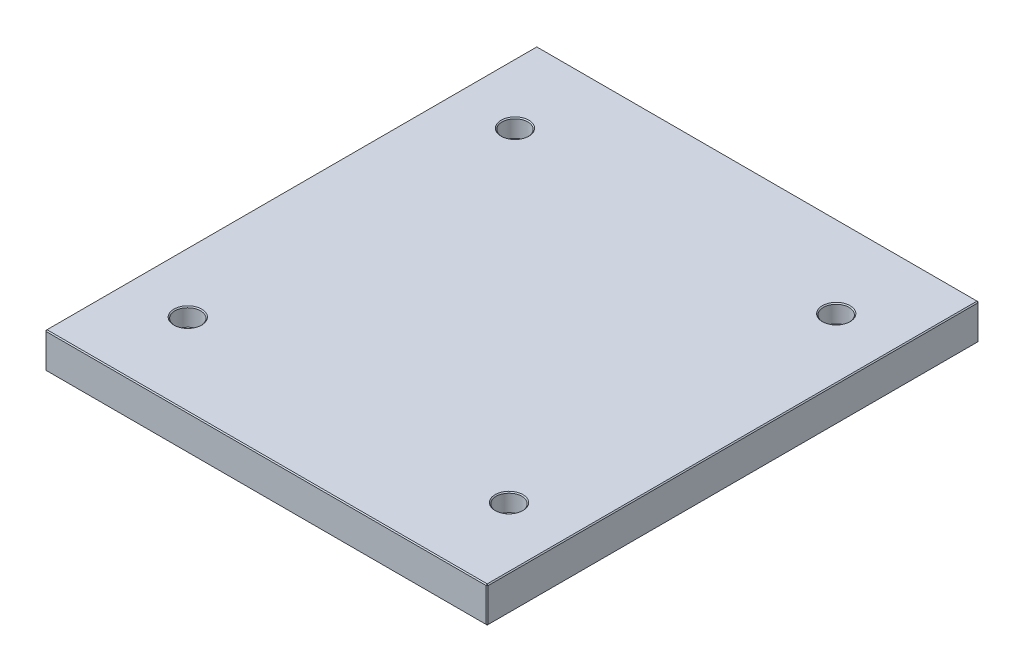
ISO-10303-21;
HEADER;
FILE_DESCRIPTION(('STEP AP214'),'2;1');
FILE_NAME('part.step','',(''),(''),'','','');
FILE_SCHEMA(('AUTOMOTIVE_DESIGN { 1 0 10303 214 1 1 1 1 }'));
ENDSEC;
DATA;
#1=APPLICATION_CONTEXT('core data for automotive mechanical design processes');
#2=APPLICATION_PROTOCOL_DEFINITION('international standard','automotive_design',2000,#1);
#3=PRODUCT_CONTEXT('',#1,'mechanical');
#4=PRODUCT('Part','Part','',(#3));
#5=PRODUCT_RELATED_PRODUCT_CATEGORY('part','',(#4));
#6=PRODUCT_DEFINITION_FORMATION('','',#4);
#7=PRODUCT_DEFINITION_CONTEXT('part definition',#1,'design');
#8=PRODUCT_DEFINITION('design','',#6,#7);
#9=PRODUCT_DEFINITION_SHAPE('','',#8);
#10=(LENGTH_UNIT() NAMED_UNIT(*) SI_UNIT(.MILLI.,.METRE.));
#11=(NAMED_UNIT(*) PLANE_ANGLE_UNIT() SI_UNIT($,.RADIAN.));
#12=(NAMED_UNIT(*) SI_UNIT($,.STERADIAN.) SOLID_ANGLE_UNIT());
#13=UNCERTAINTY_MEASURE_WITH_UNIT(LENGTH_MEASURE(1.E-05),#10,'distance_accuracy_value','');
#14=(GEOMETRIC_REPRESENTATION_CONTEXT(3) GLOBAL_UNCERTAINTY_ASSIGNED_CONTEXT((#13)) GLOBAL_UNIT_ASSIGNED_CONTEXT((#10,
#11,#12)) REPRESENTATION_CONTEXT('',''));
#15=CARTESIAN_POINT('',(0.,0.,0.));
#16=DIRECTION('',(0.,0.,1.));
#17=DIRECTION('',(1.,0.,0.));
#18=AXIS2_PLACEMENT_3D('',#15,#16,#17);
#19=CARTESIAN_POINT('',(-223.,36.,248.));
#20=DIRECTION('',(1.,0.,0.));
#21=DIRECTION('',(0.,0.,-1.));
#22=AXIS2_PLACEMENT_3D('',#19,#20,#21);
#23=PLANE('',#22);
#24=DIRECTION('',(0.,-1.,0.));
#25=VECTOR('',#24,1.);
#26=CARTESIAN_POINT('',(-223.,36.,-247.));
#27=LINE('',#26,#25);
#28=CARTESIAN_POINT('',(-223.,35.,-247.));
#29=VERTEX_POINT('',#28);
#30=CARTESIAN_POINT('',(-223.,0.999999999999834,-247.));
#31=VERTEX_POINT('',#30);
#32=EDGE_CURVE('E115',#29,#31,#27,.T.);
#33=ORIENTED_EDGE('',*,*,#32,.T.);
#34=DIRECTION('',(0.,0.,1.));
#35=VECTOR('',#34,1.);
#36=CARTESIAN_POINT('',(-223.,0.999999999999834,248.));
#37=LINE('',#36,#35);
#38=CARTESIAN_POINT('',(-223.,0.999999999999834,247.));
#39=VERTEX_POINT('',#38);
#40=EDGE_CURVE('E111',#31,#39,#37,.T.);
#41=ORIENTED_EDGE('',*,*,#40,.T.);
#42=DIRECTION('',(0.,1.,0.));
#43=VECTOR('',#42,1.);
#44=CARTESIAN_POINT('',(-223.,36.,247.));
#45=LINE('',#44,#43);
#46=CARTESIAN_POINT('',(-223.,35.,247.));
#47=VERTEX_POINT('',#46);
#48=EDGE_CURVE('E104',#39,#47,#45,.T.);
#49=ORIENTED_EDGE('',*,*,#48,.T.);
#50=DIRECTION('',(0.,0.,-1.));
#51=VECTOR('',#50,1.);
#52=CARTESIAN_POINT('',(-223.,35.,-248.));
#53=LINE('',#52,#51);
#54=EDGE_CURVE('E108',#47,#29,#53,.T.);
#55=ORIENTED_EDGE('',*,*,#54,.T.);
#56=EDGE_LOOP('',(#33,#41,#49,#55));
#57=FACE_BOUND('',#56,.T.);
#58=ADVANCED_FACE('F16',(#57),#23,.F.);
#59=CARTESIAN_POINT('',(223.,36.,248.));
#60=DIRECTION('',(0.,0.,-1.));
#61=DIRECTION('',(-1.,0.,0.));
#62=AXIS2_PLACEMENT_3D('',#59,#60,#61);
#63=PLANE('',#62);
#64=DIRECTION('',(-1.,0.,0.));
#65=VECTOR('',#64,1.);
#66=CARTESIAN_POINT('',(-223.,35.,248.));
#67=LINE('',#66,#65);
#68=CARTESIAN_POINT('',(222.,35.,248.));
#69=VERTEX_POINT('',#68);
#70=CARTESIAN_POINT('',(-222.,35.,248.));
#71=VERTEX_POINT('',#70);
#72=EDGE_CURVE('E170',#69,#71,#67,.T.);
#73=ORIENTED_EDGE('',*,*,#72,.T.);
#74=DIRECTION('',(0.,-1.,0.));
#75=VECTOR('',#74,1.);
#76=CARTESIAN_POINT('',(-222.,36.,248.));
#77=LINE('',#76,#75);
#78=CARTESIAN_POINT('',(-222.,0.99999999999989,248.));
#79=VERTEX_POINT('',#78);
#80=EDGE_CURVE('E123',#71,#79,#77,.T.);
#81=ORIENTED_EDGE('',*,*,#80,.T.);
#82=DIRECTION('',(1.,0.,0.));
#83=VECTOR('',#82,1.);
#84=CARTESIAN_POINT('',(223.,0.99999999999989,248.));
#85=LINE('',#84,#83);
#86=CARTESIAN_POINT('',(222.,0.99999999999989,248.));
#87=VERTEX_POINT('',#86);
#88=EDGE_CURVE('E174',#79,#87,#85,.T.);
#89=ORIENTED_EDGE('',*,*,#88,.T.);
#90=DIRECTION('',(0.,1.,0.));
#91=VECTOR('',#90,1.);
#92=CARTESIAN_POINT('',(222.,36.,248.));
#93=LINE('',#92,#91);
#94=EDGE_CURVE('E172',#87,#69,#93,.T.);
#95=ORIENTED_EDGE('',*,*,#94,.T.);
#96=EDGE_LOOP('',(#73,#81,#89,#95));
#97=FACE_BOUND('',#96,.T.);
#98=ADVANCED_FACE('F317',(#97),#63,.F.);
#99=CARTESIAN_POINT('',(223.,36.,248.));
#100=DIRECTION('',(-1.,0.,0.));
#101=DIRECTION('',(0.,0.,1.));
#102=AXIS2_PLACEMENT_3D('',#99,#100,#101);
#103=PLANE('',#102);
#104=DIRECTION('',(0.,0.,-1.));
#105=VECTOR('',#104,1.);
#106=CARTESIAN_POINT('',(223.,0.99999999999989,248.));
#107=LINE('',#106,#105);
#108=CARTESIAN_POINT('',(223.,0.99999999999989,247.));
#109=VERTEX_POINT('',#108);
#110=CARTESIAN_POINT('',(223.,0.99999999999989,-247.));
#111=VERTEX_POINT('',#110);
#112=EDGE_CURVE('E165',#109,#111,#107,.T.);
#113=ORIENTED_EDGE('',*,*,#112,.T.);
#114=DIRECTION('',(0.,1.,0.));
#115=VECTOR('',#114,1.);
#116=CARTESIAN_POINT('',(223.,36.,-247.));
#117=LINE('',#116,#115);
#118=CARTESIAN_POINT('',(223.,35.,-247.));
#119=VERTEX_POINT('',#118);
#120=EDGE_CURVE('E167',#111,#119,#117,.T.);
#121=ORIENTED_EDGE('',*,*,#120,.T.);
#122=DIRECTION('',(0.,0.,1.));
#123=VECTOR('',#122,1.);
#124=CARTESIAN_POINT('',(223.,35.,248.));
#125=LINE('',#124,#123);
#126=CARTESIAN_POINT('',(223.,35.,247.));
#127=VERTEX_POINT('',#126);
#128=EDGE_CURVE('E161',#119,#127,#125,.T.);
#129=ORIENTED_EDGE('',*,*,#128,.T.);
#130=DIRECTION('',(0.,-1.,0.));
#131=VECTOR('',#130,1.);
#132=CARTESIAN_POINT('',(223.,36.,247.));
#133=LINE('',#132,#131);
#134=EDGE_CURVE('E163',#127,#109,#133,.T.);
#135=ORIENTED_EDGE('',*,*,#134,.T.);
#136=EDGE_LOOP('',(#113,#121,#129,#135));
#137=FACE_BOUND('',#136,.T.);
#138=ADVANCED_FACE('F323',(#137),#103,.F.);
#139=CARTESIAN_POINT('',(223.,36.,-248.));
#140=DIRECTION('',(0.,0.,1.));
#141=DIRECTION('',(1.,0.,0.));
#142=AXIS2_PLACEMENT_3D('',#139,#140,#141);
#143=PLANE('',#142);
#144=DIRECTION('',(0.,-1.,0.));
#145=VECTOR('',#144,1.);
#146=CARTESIAN_POINT('',(222.,36.,-248.));
#147=LINE('',#146,#145);
#148=CARTESIAN_POINT('',(222.,35.,-248.));
#149=VERTEX_POINT('',#148);
#150=CARTESIAN_POINT('',(222.,0.99999999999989,-248.));
#151=VERTEX_POINT('',#150);
#152=EDGE_CURVE('E154',#149,#151,#147,.T.);
#153=ORIENTED_EDGE('',*,*,#152,.T.);
#154=DIRECTION('',(-1.,0.,0.));
#155=VECTOR('',#154,1.);
#156=CARTESIAN_POINT('',(223.,0.99999999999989,-248.));
#157=LINE('',#156,#155);
#158=CARTESIAN_POINT('',(-222.,0.99999999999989,-248.));
#159=VERTEX_POINT('',#158);
#160=EDGE_CURVE('E159',#151,#159,#157,.T.);
#161=ORIENTED_EDGE('',*,*,#160,.T.);
#162=DIRECTION('',(0.,1.,0.));
#163=VECTOR('',#162,1.);
#164=CARTESIAN_POINT('',(-222.,36.,-248.));
#165=LINE('',#164,#163);
#166=CARTESIAN_POINT('',(-222.,35.,-248.));
#167=VERTEX_POINT('',#166);
#168=EDGE_CURVE('E156',#159,#167,#165,.T.);
#169=ORIENTED_EDGE('',*,*,#168,.T.);
#170=DIRECTION('',(1.,0.,0.));
#171=VECTOR('',#170,1.);
#172=CARTESIAN_POINT('',(223.,35.,-248.));
#173=LINE('',#172,#171);
#174=EDGE_CURVE('E152',#167,#149,#173,.T.);
#175=ORIENTED_EDGE('',*,*,#174,.T.);
#176=EDGE_LOOP('',(#153,#161,#169,#175));
#177=FACE_BOUND('',#176,.T.);
#178=ADVANCED_FACE('F465',(#177),#143,.F.);
#179=CARTESIAN_POINT('',(0.,36.,0.));
#180=DIRECTION('',(0.,1.,0.));
#181=DIRECTION('',(0.,0.,1.));
#182=AXIS2_PLACEMENT_3D('',#179,#180,#181);
#183=PLANE('',#182);
#184=CARTESIAN_POINT('',(-162.,36.,165.));
#185=DIRECTION('',(0.,1.,0.));
#186=DIRECTION('',(0.,0.,1.));
#187=AXIS2_PLACEMENT_3D('',#184,#185,#186);
#188=CIRCLE('',#187,14.0000000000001);
#189=CARTESIAN_POINT('',(-162.,36.,179.));
#190=VERTEX_POINT('',#189);
#191=EDGE_CURVE('E290',#190,#190,#188,.F.);
#192=ORIENTED_EDGE('',*,*,#191,.T.);
#193=EDGE_LOOP('',(#192));
#194=FACE_BOUND('',#193,.T.);
#195=CARTESIAN_POINT('',(162.,36.,165.));
#196=DIRECTION('',(0.,1.,0.));
#197=DIRECTION('',(0.,0.,1.));
#198=AXIS2_PLACEMENT_3D('',#195,#196,#197);
#199=CIRCLE('',#198,14.0000000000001);
#200=CARTESIAN_POINT('',(162.,36.,179.));
#201=VERTEX_POINT('',#200);
#202=EDGE_CURVE('E287',#201,#201,#199,.F.);
#203=ORIENTED_EDGE('',*,*,#202,.T.);
#204=EDGE_LOOP('',(#203));
#205=FACE_BOUND('',#204,.T.);
#206=CARTESIAN_POINT('',(162.,36.,-165.));
#207=DIRECTION('',(0.,1.,0.));
#208=DIRECTION('',(0.,0.,1.));
#209=AXIS2_PLACEMENT_3D('',#206,#207,#208);
#210=CIRCLE('',#209,14.0000000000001);
#211=CARTESIAN_POINT('',(162.,36.,-151.));
#212=VERTEX_POINT('',#211);
#213=EDGE_CURVE('E284',#212,#212,#210,.F.);
#214=ORIENTED_EDGE('',*,*,#213,.T.);
#215=EDGE_LOOP('',(#214));
#216=FACE_BOUND('',#215,.T.);
#217=CARTESIAN_POINT('',(-162.,36.,-165.));
#218=DIRECTION('',(0.,1.,0.));
#219=DIRECTION('',(0.,0.,1.));
#220=AXIS2_PLACEMENT_3D('',#217,#218,#219);
#221=CIRCLE('',#220,14.0000000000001);
#222=CARTESIAN_POINT('',(-162.,36.,-151.));
#223=VERTEX_POINT('',#222);
#224=EDGE_CURVE('E281',#223,#223,#221,.F.);
#225=ORIENTED_EDGE('',*,*,#224,.T.);
#226=EDGE_LOOP('',(#225));
#227=FACE_BOUND('',#226,.T.);
#228=DIRECTION('',(0.,0.,-1.));
#229=VECTOR('',#228,1.);
#230=CARTESIAN_POINT('',(222.,36.,-248.));
#231=LINE('',#230,#229);
#232=CARTESIAN_POINT('',(222.,36.,247.));
#233=VERTEX_POINT('',#232);
#234=CARTESIAN_POINT('',(222.,36.,-247.));
#235=VERTEX_POINT('',#234);
#236=EDGE_CURVE('E31',#233,#235,#231,.T.);
#237=ORIENTED_EDGE('',*,*,#236,.T.);
#238=DIRECTION('',(-1.,0.,0.));
#239=VECTOR('',#238,1.);
#240=CARTESIAN_POINT('',(-223.,36.,-247.));
#241=LINE('',#240,#239);
#242=CARTESIAN_POINT('',(-222.,36.,-247.));
#243=VERTEX_POINT('',#242);
#244=EDGE_CURVE('E190',#235,#243,#241,.T.);
#245=ORIENTED_EDGE('',*,*,#244,.T.);
#246=DIRECTION('',(0.,0.,1.));
#247=VECTOR('',#246,1.);
#248=CARTESIAN_POINT('',(-222.,36.,248.));
#249=LINE('',#248,#247);
#250=CARTESIAN_POINT('',(-222.,36.,247.));
#251=VERTEX_POINT('',#250);
#252=EDGE_CURVE('E186',#243,#251,#249,.T.);
#253=ORIENTED_EDGE('',*,*,#252,.T.);
#254=DIRECTION('',(1.,0.,0.));
#255=VECTOR('',#254,1.);
#256=CARTESIAN_POINT('',(223.,36.,247.));
#257=LINE('',#256,#255);
#258=EDGE_CURVE('E36',#251,#233,#257,.T.);
#259=ORIENTED_EDGE('',*,*,#258,.T.);
#260=EDGE_LOOP('',(#237,#245,#253,#259));
#261=FACE_BOUND('',#260,.T.);
#262=ADVANCED_FACE('F462',(#194,#205,#216,#227,#261),#183,.T.);
#263=CARTESIAN_POINT('',(0.,0.,0.));
#264=DIRECTION('',(0.,1.,0.));
#265=DIRECTION('',(0.,0.,1.));
#266=AXIS2_PLACEMENT_3D('',#263,#264,#265);
#267=PLANE('',#266);
#268=CARTESIAN_POINT('',(162.,0.,-165.));
#269=DIRECTION('',(0.,1.,0.));
#270=DIRECTION('',(0.,0.,1.));
#271=AXIS2_PLACEMENT_3D('',#268,#269,#270);
#272=CIRCLE('',#271,10.);
#273=CARTESIAN_POINT('',(162.,0.,-155.));
#274=VERTEX_POINT('',#273);
#275=EDGE_CURVE('E263',#274,#274,#272,.T.);
#276=ORIENTED_EDGE('',*,*,#275,.T.);
#277=EDGE_LOOP('',(#276));
#278=FACE_BOUND('',#277,.T.);
#279=CARTESIAN_POINT('',(162.,0.,165.));
#280=DIRECTION('',(0.,1.,0.));
#281=DIRECTION('',(0.,0.,1.));
#282=AXIS2_PLACEMENT_3D('',#279,#280,#281);
#283=CIRCLE('',#282,9.99999999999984);
#284=CARTESIAN_POINT('',(162.,0.,175.));
#285=VERTEX_POINT('',#284);
#286=EDGE_CURVE('E260',#285,#285,#283,.T.);
#287=ORIENTED_EDGE('',*,*,#286,.T.);
#288=EDGE_LOOP('',(#287));
#289=FACE_BOUND('',#288,.T.);
#290=CARTESIAN_POINT('',(-162.,0.,165.));
#291=DIRECTION('',(0.,1.,0.));
#292=DIRECTION('',(0.,0.,1.));
#293=AXIS2_PLACEMENT_3D('',#290,#291,#292);
#294=CIRCLE('',#293,10.);
#295=CARTESIAN_POINT('',(-162.,0.,175.));
#296=VERTEX_POINT('',#295);
#297=EDGE_CURVE('E257',#296,#296,#294,.T.);
#298=ORIENTED_EDGE('',*,*,#297,.T.);
#299=EDGE_LOOP('',(#298));
#300=FACE_BOUND('',#299,.T.);
#301=CARTESIAN_POINT('',(-162.,0.,-165.));
#302=DIRECTION('',(0.,1.,0.));
#303=DIRECTION('',(0.,0.,1.));
#304=AXIS2_PLACEMENT_3D('',#301,#302,#303);
#305=CIRCLE('',#304,9.99999999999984);
#306=CARTESIAN_POINT('',(-162.,0.,-155.));
#307=VERTEX_POINT('',#306);
#308=EDGE_CURVE('E192',#307,#307,#305,.T.);
#309=ORIENTED_EDGE('',*,*,#308,.T.);
#310=EDGE_LOOP('',(#309));
#311=FACE_BOUND('',#310,.T.);
#312=DIRECTION('',(0.,0.,1.));
#313=VECTOR('',#312,1.);
#314=CARTESIAN_POINT('',(222.,0.,0.));
#315=LINE('',#314,#313);
#316=CARTESIAN_POINT('',(222.,0.,-247.));
#317=VERTEX_POINT('',#316);
#318=CARTESIAN_POINT('',(222.,0.,247.));
#319=VERTEX_POINT('',#318);
#320=EDGE_CURVE('E177',#317,#319,#315,.T.);
#321=ORIENTED_EDGE('',*,*,#320,.T.);
#322=DIRECTION('',(-1.,0.,0.));
#323=VECTOR('',#322,1.);
#324=CARTESIAN_POINT('',(0.,0.,247.));
#325=LINE('',#324,#323);
#326=CARTESIAN_POINT('',(-222.,0.,247.));
#327=VERTEX_POINT('',#326);
#328=EDGE_CURVE('E183',#319,#327,#325,.T.);
#329=ORIENTED_EDGE('',*,*,#328,.T.);
#330=DIRECTION('',(0.,0.,-1.));
#331=VECTOR('',#330,1.);
#332=CARTESIAN_POINT('',(-222.,0.,0.));
#333=LINE('',#332,#331);
#334=CARTESIAN_POINT('',(-222.,0.,-247.));
#335=VERTEX_POINT('',#334);
#336=EDGE_CURVE('E181',#327,#335,#333,.T.);
#337=ORIENTED_EDGE('',*,*,#336,.T.);
#338=DIRECTION('',(1.,0.,0.));
#339=VECTOR('',#338,1.);
#340=CARTESIAN_POINT('',(0.,0.,-247.));
#341=LINE('',#340,#339);
#342=EDGE_CURVE('E179',#335,#317,#341,.T.);
#343=ORIENTED_EDGE('',*,*,#342,.T.);
#344=EDGE_LOOP('',(#321,#329,#337,#343));
#345=FACE_BOUND('',#344,.T.);
#346=ADVANCED_FACE('F402',(#278,#289,#300,#311,#345),#267,.F.);
#347=CARTESIAN_POINT('',(223.,36.,247.));
#348=DIRECTION('',(-0.707106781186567,0.,-0.707106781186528));
#349=DIRECTION('',(0.,-1.,0.));
#350=AXIS2_PLACEMENT_3D('',#347,#348,#349);
#351=PLANE('',#350);
#352=DIRECTION('',(-0.707106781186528,0.,0.707106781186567));
#353=VECTOR('',#352,1.);
#354=CARTESIAN_POINT('',(222.,35.,248.));
#355=LINE('',#354,#353);
#356=EDGE_CURVE('E141',#69,#127,#355,.F.);
#357=ORIENTED_EDGE('',*,*,#356,.F.);
#358=ORIENTED_EDGE('',*,*,#94,.F.);
#359=DIRECTION('',(0.707106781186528,0.,-0.707106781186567));
#360=VECTOR('',#359,1.);
#361=CARTESIAN_POINT('',(222.,0.99999999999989,248.));
#362=LINE('',#361,#360);
#363=EDGE_CURVE('E144',#109,#87,#362,.F.);
#364=ORIENTED_EDGE('',*,*,#363,.F.);
#365=ORIENTED_EDGE('',*,*,#134,.F.);
#366=EDGE_LOOP('',(#357,#358,#364,#365));
#367=FACE_BOUND('',#366,.T.);
#368=ADVANCED_FACE('F398',(#367),#351,.F.);
#369=CARTESIAN_POINT('',(222.,35.,248.));
#370=DIRECTION('',(0.577350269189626,0.577350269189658,0.577350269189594));
#371=DIRECTION('',(-0.707106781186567,0.707106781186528,0.));
#372=AXIS2_PLACEMENT_3D('',#369,#370,#371);
#373=PLANE('',#372);
#374=DIRECTION('',(0.,-0.707106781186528,0.707106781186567));
#375=VECTOR('',#374,1.);
#376=CARTESIAN_POINT('',(222.,35.,248.));
#377=LINE('',#376,#375);
#378=EDGE_CURVE('E235',#69,#233,#377,.F.);
#379=ORIENTED_EDGE('',*,*,#378,.F.);
#380=ORIENTED_EDGE('',*,*,#356,.T.);
#381=DIRECTION('',(-0.707106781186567,0.707106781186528,0.));
#382=VECTOR('',#381,1.);
#383=CARTESIAN_POINT('',(222.5,35.5,247.));
#384=LINE('',#383,#382);
#385=EDGE_CURVE('E237',#233,#127,#384,.F.);
#386=ORIENTED_EDGE('',*,*,#385,.F.);
#387=EDGE_LOOP('',(#379,#380,#386));
#388=FACE_BOUND('',#387,.T.);
#389=ADVANCED_FACE('F394',(#388),#373,.T.);
#390=CARTESIAN_POINT('',(222.,0.99999999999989,248.));
#391=DIRECTION('',(0.577350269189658,-0.577350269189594,0.577350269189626));
#392=DIRECTION('',(0.707106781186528,0.,-0.707106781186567));
#393=AXIS2_PLACEMENT_3D('',#390,#391,#392);
#394=PLANE('',#393);
#395=DIRECTION('',(-0.707106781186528,-0.707106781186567,0.));
#396=VECTOR('',#395,1.);
#397=CARTESIAN_POINT('',(222.5,0.499999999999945,247.));
#398=LINE('',#397,#396);
#399=EDGE_CURVE('E229',#109,#319,#398,.T.);
#400=ORIENTED_EDGE('',*,*,#399,.F.);
#401=ORIENTED_EDGE('',*,*,#363,.T.);
#402=DIRECTION('',(0.,0.707106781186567,0.707106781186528));
#403=VECTOR('',#402,1.);
#404=CARTESIAN_POINT('',(222.,0.99999999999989,248.));
#405=LINE('',#404,#403);
#406=EDGE_CURVE('E232',#319,#87,#405,.T.);
#407=ORIENTED_EDGE('',*,*,#406,.F.);
#408=EDGE_LOOP('',(#400,#401,#407));
#409=FACE_BOUND('',#408,.T.);
#410=ADVANCED_FACE('F390',(#409),#394,.T.);
#411=CARTESIAN_POINT('',(222.,36.,0.));
#412=DIRECTION('',(0.707106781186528,0.707106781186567,0.));
#413=DIRECTION('',(0.,0.,1.));
#414=AXIS2_PLACEMENT_3D('',#411,#412,#413);
#415=PLANE('',#414);
#416=ORIENTED_EDGE('',*,*,#385,.T.);
#417=ORIENTED_EDGE('',*,*,#128,.F.);
#418=DIRECTION('',(0.707106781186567,-0.707106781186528,0.));
#419=VECTOR('',#418,1.);
#420=CARTESIAN_POINT('',(223.,35.,-247.));
#421=LINE('',#420,#419);
#422=EDGE_CURVE('E224',#235,#119,#421,.T.);
#423=ORIENTED_EDGE('',*,*,#422,.F.);
#424=ORIENTED_EDGE('',*,*,#236,.F.);
#425=EDGE_LOOP('',(#416,#417,#423,#424));
#426=FACE_BOUND('',#425,.T.);
#427=ADVANCED_FACE('F386',(#426),#415,.T.);
#428=CARTESIAN_POINT('',(0.,36.,247.));
#429=DIRECTION('',(0.,0.707106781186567,0.707106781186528));
#430=DIRECTION('',(-1.,0.,0.));
#431=AXIS2_PLACEMENT_3D('',#428,#429,#430);
#432=PLANE('',#431);
#433=ORIENTED_EDGE('',*,*,#378,.T.);
#434=ORIENTED_EDGE('',*,*,#258,.F.);
#435=DIRECTION('',(0.,0.707106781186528,-0.707106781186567));
#436=VECTOR('',#435,1.);
#437=CARTESIAN_POINT('',(-222.,35.5,247.5));
#438=LINE('',#437,#436);
#439=EDGE_CURVE('E127',#71,#251,#438,.T.);
#440=ORIENTED_EDGE('',*,*,#439,.F.);
#441=ORIENTED_EDGE('',*,*,#72,.F.);
#442=EDGE_LOOP('',(#433,#434,#440,#441));
#443=FACE_BOUND('',#442,.T.);
#444=ADVANCED_FACE('F383',(#443),#432,.T.);
#445=CARTESIAN_POINT('',(-222.,36.,248.));
#446=DIRECTION('',(0.707106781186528,0.,-0.707106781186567));
#447=DIRECTION('',(0.,-1.,0.));
#448=AXIS2_PLACEMENT_3D('',#445,#446,#447);
#449=PLANE('',#448);
#450=DIRECTION('',(0.707106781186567,0.,0.707106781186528));
#451=VECTOR('',#450,1.);
#452=CARTESIAN_POINT('',(-222.,0.99999999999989,248.));
#453=LINE('',#452,#451);
#454=EDGE_CURVE('E128',#79,#39,#453,.F.);
#455=ORIENTED_EDGE('',*,*,#454,.F.);
#456=ORIENTED_EDGE('',*,*,#80,.F.);
#457=DIRECTION('',(-0.707106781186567,0.,-0.707106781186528));
#458=VECTOR('',#457,1.);
#459=CARTESIAN_POINT('',(-223.,35.,247.));
#460=LINE('',#459,#458);
#461=EDGE_CURVE('E119',#47,#71,#460,.F.);
#462=ORIENTED_EDGE('',*,*,#461,.F.);
#463=ORIENTED_EDGE('',*,*,#48,.F.);
#464=EDGE_LOOP('',(#455,#456,#462,#463));
#465=FACE_BOUND('',#464,.T.);
#466=ADVANCED_FACE('F121',(#465),#449,.F.);
#467=CARTESIAN_POINT('',(223.,0.99999999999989,248.));
#468=DIRECTION('',(0.,0.707106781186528,-0.707106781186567));
#469=DIRECTION('',(1.,0.,0.));
#470=AXIS2_PLACEMENT_3D('',#467,#468,#469);
#471=PLANE('',#470);
#472=ORIENTED_EDGE('',*,*,#406,.T.);
#473=ORIENTED_EDGE('',*,*,#88,.F.);
#474=DIRECTION('',(0.,-0.707106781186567,-0.707106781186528));
#475=VECTOR('',#474,1.);
#476=CARTESIAN_POINT('',(-222.,0.99999999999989,248.));
#477=LINE('',#476,#475);
#478=EDGE_CURVE('E220',#327,#79,#477,.F.);
#479=ORIENTED_EDGE('',*,*,#478,.F.);
#480=ORIENTED_EDGE('',*,*,#328,.F.);
#481=EDGE_LOOP('',(#472,#473,#479,#480));
#482=FACE_BOUND('',#481,.T.);
#483=ADVANCED_FACE('F376',(#482),#471,.F.);
#484=CARTESIAN_POINT('',(223.,0.99999999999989,248.));
#485=DIRECTION('',(-0.707106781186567,0.707106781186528,0.));
#486=DIRECTION('',(0.,0.,-1.));
#487=AXIS2_PLACEMENT_3D('',#484,#485,#486);
#488=PLANE('',#487);
#489=ORIENTED_EDGE('',*,*,#399,.T.);
#490=ORIENTED_EDGE('',*,*,#320,.F.);
#491=DIRECTION('',(0.707106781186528,0.707106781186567,0.));
#492=VECTOR('',#491,1.);
#493=CARTESIAN_POINT('',(222.5,0.499999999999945,-247.));
#494=LINE('',#493,#492);
#495=EDGE_CURVE('E217',#111,#317,#494,.F.);
#496=ORIENTED_EDGE('',*,*,#495,.F.);
#497=ORIENTED_EDGE('',*,*,#112,.F.);
#498=EDGE_LOOP('',(#489,#490,#496,#497));
#499=FACE_BOUND('',#498,.T.);
#500=ADVANCED_FACE('F372',(#499),#488,.F.);
#501=CARTESIAN_POINT('',(222.,36.,-248.));
#502=DIRECTION('',(-0.707106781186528,0.,0.707106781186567));
#503=DIRECTION('',(0.,-1.,0.));
#504=AXIS2_PLACEMENT_3D('',#501,#502,#503);
#505=PLANE('',#504);
#506=DIRECTION('',(0.707106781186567,0.,0.707106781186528));
#507=VECTOR('',#506,1.);
#508=CARTESIAN_POINT('',(223.,35.,-247.));
#509=LINE('',#508,#507);
#510=EDGE_CURVE('E226',#119,#149,#509,.F.);
#511=ORIENTED_EDGE('',*,*,#510,.F.);
#512=ORIENTED_EDGE('',*,*,#120,.F.);
#513=DIRECTION('',(-0.707106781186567,0.,-0.707106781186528));
#514=VECTOR('',#513,1.);
#515=CARTESIAN_POINT('',(222.,0.99999999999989,-248.));
#516=LINE('',#515,#514);
#517=EDGE_CURVE('E214',#151,#111,#516,.F.);
#518=ORIENTED_EDGE('',*,*,#517,.F.);
#519=ORIENTED_EDGE('',*,*,#152,.F.);
#520=EDGE_LOOP('',(#511,#512,#518,#519));
#521=FACE_BOUND('',#520,.T.);
#522=ADVANCED_FACE('F368',(#521),#505,.F.);
#523=CARTESIAN_POINT('',(223.,35.,-247.));
#524=DIRECTION('',(0.577350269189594,0.577350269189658,-0.577350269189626));
#525=DIRECTION('',(0.,0.707106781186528,0.707106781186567));
#526=AXIS2_PLACEMENT_3D('',#523,#524,#525);
#527=PLANE('',#526);
#528=ORIENTED_EDGE('',*,*,#422,.T.);
#529=ORIENTED_EDGE('',*,*,#510,.T.);
#530=DIRECTION('',(0.,0.707106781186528,0.707106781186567));
#531=VECTOR('',#530,1.);
#532=CARTESIAN_POINT('',(222.,35.5,-247.5));
#533=LINE('',#532,#531);
#534=EDGE_CURVE('E135',#235,#149,#533,.F.);
#535=ORIENTED_EDGE('',*,*,#534,.F.);
#536=EDGE_LOOP('',(#528,#529,#535));
#537=FACE_BOUND('',#536,.T.);
#538=ADVANCED_FACE('F365',(#537),#527,.T.);
#539=CARTESIAN_POINT('',(-223.,35.,247.));
#540=DIRECTION('',(-0.577350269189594,0.577350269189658,0.577350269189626));
#541=DIRECTION('',(0.,-0.707106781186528,0.707106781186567));
#542=AXIS2_PLACEMENT_3D('',#539,#540,#541);
#543=PLANE('',#542);
#544=ORIENTED_EDGE('',*,*,#461,.T.);
#545=ORIENTED_EDGE('',*,*,#439,.T.);
#546=DIRECTION('',(-0.707106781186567,-0.707106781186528,0.));
#547=VECTOR('',#546,1.);
#548=CARTESIAN_POINT('',(-223.,35.,247.));
#549=LINE('',#548,#547);
#550=EDGE_CURVE('E131',#47,#251,#549,.F.);
#551=ORIENTED_EDGE('',*,*,#550,.F.);
#552=EDGE_LOOP('',(#544,#545,#551));
#553=FACE_BOUND('',#552,.T.);
#554=ADVANCED_FACE('F132',(#553),#543,.T.);
#555=CARTESIAN_POINT('',(-222.,0.99999999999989,248.));
#556=DIRECTION('',(-0.577350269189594,-0.577350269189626,0.577350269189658));
#557=DIRECTION('',(0.,-0.707106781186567,-0.707106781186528));
#558=AXIS2_PLACEMENT_3D('',#555,#556,#557);
#559=PLANE('',#558);
#560=ORIENTED_EDGE('',*,*,#478,.T.);
#561=ORIENTED_EDGE('',*,*,#454,.T.);
#562=DIRECTION('',(-0.707106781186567,0.707106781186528,0.));
#563=VECTOR('',#562,1.);
#564=CARTESIAN_POINT('',(-222.5,0.499999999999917,247.));
#565=LINE('',#564,#563);
#566=EDGE_CURVE('E136',#327,#39,#565,.T.);
#567=ORIENTED_EDGE('',*,*,#566,.F.);
#568=EDGE_LOOP('',(#560,#561,#567));
#569=FACE_BOUND('',#568,.T.);
#570=ADVANCED_FACE('F358',(#569),#559,.T.);
#571=CARTESIAN_POINT('',(222.,0.99999999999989,-248.));
#572=DIRECTION('',(0.577350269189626,-0.577350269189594,-0.577350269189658));
#573=DIRECTION('',(-0.707106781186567,0.,-0.707106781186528));
#574=AXIS2_PLACEMENT_3D('',#571,#572,#573);
#575=PLANE('',#574);
#576=ORIENTED_EDGE('',*,*,#517,.T.);
#577=ORIENTED_EDGE('',*,*,#495,.T.);
#578=DIRECTION('',(0.,-0.707106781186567,0.707106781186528));
#579=VECTOR('',#578,1.);
#580=CARTESIAN_POINT('',(222.,0.99999999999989,-248.));
#581=LINE('',#580,#579);
#582=EDGE_CURVE('E207',#151,#317,#581,.T.);
#583=ORIENTED_EDGE('',*,*,#582,.F.);
#584=EDGE_LOOP('',(#576,#577,#583));
#585=FACE_BOUND('',#584,.T.);
#586=ADVANCED_FACE('F354',(#585),#575,.T.);
#587=CARTESIAN_POINT('',(0.,36.,-247.));
#588=DIRECTION('',(0.,0.707106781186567,-0.707106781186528));
#589=DIRECTION('',(1.,0.,0.));
#590=AXIS2_PLACEMENT_3D('',#587,#588,#589);
#591=PLANE('',#590);
#592=ORIENTED_EDGE('',*,*,#534,.T.);
#593=ORIENTED_EDGE('',*,*,#174,.F.);
#594=DIRECTION('',(0.,-0.707106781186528,-0.707106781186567));
#595=VECTOR('',#594,1.);
#596=CARTESIAN_POINT('',(-222.,35.,-248.));
#597=LINE('',#596,#595);
#598=EDGE_CURVE('E204',#243,#167,#597,.T.);
#599=ORIENTED_EDGE('',*,*,#598,.F.);
#600=ORIENTED_EDGE('',*,*,#244,.F.);
#601=EDGE_LOOP('',(#592,#593,#599,#600));
#602=FACE_BOUND('',#601,.T.);
#603=ADVANCED_FACE('F351',(#602),#591,.T.);
#604=CARTESIAN_POINT('',(-222.,36.,0.));
#605=DIRECTION('',(-0.707106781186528,0.707106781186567,0.));
#606=DIRECTION('',(0.,0.,-1.));
#607=AXIS2_PLACEMENT_3D('',#604,#605,#606);
#608=PLANE('',#607);
#609=ORIENTED_EDGE('',*,*,#550,.T.);
#610=ORIENTED_EDGE('',*,*,#252,.F.);
#611=DIRECTION('',(0.707106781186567,0.707106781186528,0.));
#612=VECTOR('',#611,1.);
#613=CARTESIAN_POINT('',(-222.5,35.5,-247.));
#614=LINE('',#613,#612);
#615=EDGE_CURVE('E139',#29,#243,#614,.T.);
#616=ORIENTED_EDGE('',*,*,#615,.F.);
#617=ORIENTED_EDGE('',*,*,#54,.F.);
#618=EDGE_LOOP('',(#609,#610,#616,#617));
#619=FACE_BOUND('',#618,.T.);
#620=ADVANCED_FACE('F138',(#619),#608,.T.);
#621=CARTESIAN_POINT('',(-223.,0.999999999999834,248.));
#622=DIRECTION('',(0.707106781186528,0.707106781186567,0.));
#623=DIRECTION('',(0.,0.,1.));
#624=AXIS2_PLACEMENT_3D('',#621,#622,#623);
#625=PLANE('',#624);
#626=ORIENTED_EDGE('',*,*,#566,.T.);
#627=ORIENTED_EDGE('',*,*,#40,.F.);
#628=DIRECTION('',(0.707106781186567,-0.707106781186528,0.));
#629=VECTOR('',#628,1.);
#630=CARTESIAN_POINT('',(-223.,0.999999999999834,-247.));
#631=LINE('',#630,#629);
#632=EDGE_CURVE('E200',#335,#31,#631,.F.);
#633=ORIENTED_EDGE('',*,*,#632,.F.);
#634=ORIENTED_EDGE('',*,*,#336,.F.);
#635=EDGE_LOOP('',(#626,#627,#633,#634));
#636=FACE_BOUND('',#635,.T.);
#637=ADVANCED_FACE('F344',(#636),#625,.F.);
#638=CARTESIAN_POINT('',(223.,0.99999999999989,-248.));
#639=DIRECTION('',(0.,0.707106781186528,0.707106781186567));
#640=DIRECTION('',(-1.,0.,0.));
#641=AXIS2_PLACEMENT_3D('',#638,#639,#640);
#642=PLANE('',#641);
#643=ORIENTED_EDGE('',*,*,#582,.T.);
#644=ORIENTED_EDGE('',*,*,#342,.F.);
#645=DIRECTION('',(0.,0.707106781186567,-0.707106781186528));
#646=VECTOR('',#645,1.);
#647=CARTESIAN_POINT('',(-222.,0.499999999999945,-247.5));
#648=LINE('',#647,#646);
#649=EDGE_CURVE('E197',#159,#335,#648,.F.);
#650=ORIENTED_EDGE('',*,*,#649,.F.);
#651=ORIENTED_EDGE('',*,*,#160,.F.);
#652=EDGE_LOOP('',(#643,#644,#650,#651));
#653=FACE_BOUND('',#652,.T.);
#654=ADVANCED_FACE('F340',(#653),#642,.F.);
#655=CARTESIAN_POINT('',(-222.,35.,-248.));
#656=DIRECTION('',(-0.577350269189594,0.577350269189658,-0.577350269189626));
#657=DIRECTION('',(0.,0.707106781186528,0.707106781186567));
#658=AXIS2_PLACEMENT_3D('',#655,#656,#657);
#659=PLANE('',#658);
#660=ORIENTED_EDGE('',*,*,#615,.T.);
#661=ORIENTED_EDGE('',*,*,#598,.T.);
#662=DIRECTION('',(0.707106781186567,0.,-0.707106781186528));
#663=VECTOR('',#662,1.);
#664=CARTESIAN_POINT('',(-222.,35.,-248.));
#665=LINE('',#664,#663);
#666=EDGE_CURVE('E195',#29,#167,#665,.T.);
#667=ORIENTED_EDGE('',*,*,#666,.F.);
#668=EDGE_LOOP('',(#660,#661,#667));
#669=FACE_BOUND('',#668,.T.);
#670=ADVANCED_FACE('F336',(#669),#659,.T.);
#671=CARTESIAN_POINT('',(-223.,0.999999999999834,-247.));
#672=DIRECTION('',(-0.577350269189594,-0.577350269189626,-0.577350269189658));
#673=DIRECTION('',(0.,0.707106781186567,-0.707106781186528));
#674=AXIS2_PLACEMENT_3D('',#671,#672,#673);
#675=PLANE('',#674);
#676=ORIENTED_EDGE('',*,*,#649,.T.);
#677=ORIENTED_EDGE('',*,*,#632,.T.);
#678=DIRECTION('',(-0.707106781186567,0.,0.707106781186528));
#679=VECTOR('',#678,1.);
#680=CARTESIAN_POINT('',(-223.,0.999999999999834,-247.));
#681=LINE('',#680,#679);
#682=EDGE_CURVE('E193',#159,#31,#681,.T.);
#683=ORIENTED_EDGE('',*,*,#682,.F.);
#684=EDGE_LOOP('',(#676,#677,#683));
#685=FACE_BOUND('',#684,.T.);
#686=ADVANCED_FACE('F332',(#685),#675,.T.);
#687=CARTESIAN_POINT('',(-223.,36.,-247.));
#688=DIRECTION('',(0.707106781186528,0.,0.707106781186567));
#689=DIRECTION('',(0.,-1.,0.));
#690=AXIS2_PLACEMENT_3D('',#687,#688,#689);
#691=PLANE('',#690);
#692=ORIENTED_EDGE('',*,*,#666,.T.);
#693=ORIENTED_EDGE('',*,*,#168,.F.);
#694=ORIENTED_EDGE('',*,*,#682,.T.);
#695=ORIENTED_EDGE('',*,*,#32,.F.);
#696=EDGE_LOOP('',(#692,#693,#694,#695));
#697=FACE_BOUND('',#696,.T.);
#698=ADVANCED_FACE('F328',(#697),#691,.F.);
#699=CARTESIAN_POINT('',(-162.,18.,-165.));
#700=DIRECTION('',(0.,1.,0.));
#701=DIRECTION('',(0.,0.,1.));
#702=AXIS2_PLACEMENT_3D('',#699,#700,#701);
#703=CYLINDRICAL_SURFACE('',#702,13.);
#704=CARTESIAN_POINT('',(-162.,35.,-165.));
#705=DIRECTION('',(0.,1.,0.));
#706=DIRECTION('',(0.,0.,1.));
#707=AXIS2_PLACEMENT_3D('',#704,#705,#706);
#708=CIRCLE('',#707,13.);
#709=CARTESIAN_POINT('',(-162.,35.,-152.));
#710=VERTEX_POINT('',#709);
#711=EDGE_CURVE('E10',#710,#710,#708,.T.);
#712=ORIENTED_EDGE('',*,*,#711,.T.);
#713=EDGE_LOOP('',(#712));
#714=FACE_BOUND('',#713,.T.);
#715=CARTESIAN_POINT('',(-162.,18.,-165.));
#716=DIRECTION('',(0.,1.,0.));
#717=DIRECTION('',(0.,0.,1.));
#718=AXIS2_PLACEMENT_3D('',#715,#716,#717);
#719=CIRCLE('',#718,13.);
#720=CARTESIAN_POINT('',(-162.,18.,-152.));
#721=VERTEX_POINT('',#720);
#722=EDGE_CURVE('E147',#721,#721,#719,.T.);
#723=ORIENTED_EDGE('',*,*,#722,.F.);
#724=EDGE_LOOP('',(#723));
#725=FACE_BOUND('',#724,.T.);
#726=ADVANCED_FACE('F331',(#714,#725),#703,.F.);
#727=CARTESIAN_POINT('',(-162.,18.,-165.));
#728=DIRECTION('',(0.,1.,0.));
#729=DIRECTION('',(0.,0.,1.));
#730=AXIS2_PLACEMENT_3D('',#727,#728,#729);
#731=PLANE('',#730);
#732=CARTESIAN_POINT('',(-162.,18.,-165.));
#733=DIRECTION('',(0.,1.,0.));
#734=DIRECTION('',(0.,0.,1.));
#735=AXIS2_PLACEMENT_3D('',#732,#733,#734);
#736=CIRCLE('',#735,9.);
#737=CARTESIAN_POINT('',(-162.,18.,-156.));
#738=VERTEX_POINT('',#737);
#739=EDGE_CURVE('E251',#738,#738,#736,.T.);
#740=ORIENTED_EDGE('',*,*,#739,.F.);
#741=EDGE_LOOP('',(#740));
#742=FACE_BOUND('',#741,.T.);
#743=ORIENTED_EDGE('',*,*,#722,.T.);
#744=EDGE_LOOP('',(#743));
#745=FACE_BOUND('',#744,.T.);
#746=ADVANCED_FACE('F450',(#742,#745),#731,.T.);
#747=CARTESIAN_POINT('',(162.,18.,-165.));
#748=DIRECTION('',(0.,1.,0.));
#749=DIRECTION('',(0.,0.,1.));
#750=AXIS2_PLACEMENT_3D('',#747,#748,#749);
#751=CYLINDRICAL_SURFACE('',#750,13.);
#752=CARTESIAN_POINT('',(162.,35.,-165.));
#753=DIRECTION('',(0.,1.,0.));
#754=DIRECTION('',(0.,0.,1.));
#755=AXIS2_PLACEMENT_3D('',#752,#753,#754);
#756=CIRCLE('',#755,13.);
#757=CARTESIAN_POINT('',(162.,35.,-152.));
#758=VERTEX_POINT('',#757);
#759=EDGE_CURVE('E24',#758,#758,#756,.T.);
#760=ORIENTED_EDGE('',*,*,#759,.T.);
#761=EDGE_LOOP('',(#760));
#762=FACE_BOUND('',#761,.T.);
#763=CARTESIAN_POINT('',(162.,18.,-165.));
#764=DIRECTION('',(0.,1.,0.));
#765=DIRECTION('',(0.,0.,1.));
#766=AXIS2_PLACEMENT_3D('',#763,#764,#765);
#767=CIRCLE('',#766,13.);
#768=CARTESIAN_POINT('',(162.,18.,-152.));
#769=VERTEX_POINT('',#768);
#770=EDGE_CURVE('E441',#769,#769,#767,.T.);
#771=ORIENTED_EDGE('',*,*,#770,.F.);
#772=EDGE_LOOP('',(#771));
#773=FACE_BOUND('',#772,.T.);
#774=ADVANCED_FACE('F298',(#762,#773),#751,.F.);
#775=CARTESIAN_POINT('',(162.,18.,-165.));
#776=DIRECTION('',(0.,1.,0.));
#777=DIRECTION('',(0.,0.,1.));
#778=AXIS2_PLACEMENT_3D('',#775,#776,#777);
#779=PLANE('',#778);
#780=CARTESIAN_POINT('',(162.,18.,-165.));
#781=DIRECTION('',(0.,1.,0.));
#782=DIRECTION('',(0.,0.,1.));
#783=AXIS2_PLACEMENT_3D('',#780,#781,#782);
#784=CIRCLE('',#783,9.);
#785=CARTESIAN_POINT('',(162.,18.,-156.));
#786=VERTEX_POINT('',#785);
#787=EDGE_CURVE('E248',#786,#786,#784,.T.);
#788=ORIENTED_EDGE('',*,*,#787,.F.);
#789=EDGE_LOOP('',(#788));
#790=FACE_BOUND('',#789,.T.);
#791=ORIENTED_EDGE('',*,*,#770,.T.);
#792=EDGE_LOOP('',(#791));
#793=FACE_BOUND('',#792,.T.);
#794=ADVANCED_FACE('F738',(#790,#793),#779,.T.);
#795=CARTESIAN_POINT('',(162.,18.,165.));
#796=DIRECTION('',(0.,1.,0.));
#797=DIRECTION('',(0.,0.,1.));
#798=AXIS2_PLACEMENT_3D('',#795,#796,#797);
#799=CYLINDRICAL_SURFACE('',#798,13.);
#800=CARTESIAN_POINT('',(162.,35.,165.));
#801=DIRECTION('',(0.,1.,0.));
#802=DIRECTION('',(0.,0.,1.));
#803=AXIS2_PLACEMENT_3D('',#800,#801,#802);
#804=CIRCLE('',#803,13.);
#805=CARTESIAN_POINT('',(162.,35.,178.));
#806=VERTEX_POINT('',#805);
#807=EDGE_CURVE('E293',#806,#806,#804,.T.);
#808=ORIENTED_EDGE('',*,*,#807,.T.);
#809=EDGE_LOOP('',(#808));
#810=FACE_BOUND('',#809,.T.);
#811=CARTESIAN_POINT('',(162.,18.,165.));
#812=DIRECTION('',(0.,1.,0.));
#813=DIRECTION('',(0.,0.,1.));
#814=AXIS2_PLACEMENT_3D('',#811,#812,#813);
#815=CIRCLE('',#814,13.);
#816=CARTESIAN_POINT('',(162.,18.,178.));
#817=VERTEX_POINT('',#816);
#818=EDGE_CURVE('E439',#817,#817,#815,.T.);
#819=ORIENTED_EDGE('',*,*,#818,.F.);
#820=EDGE_LOOP('',(#819));
#821=FACE_BOUND('',#820,.T.);
#822=ADVANCED_FACE('F730',(#810,#821),#799,.F.);
#823=CARTESIAN_POINT('',(162.,18.,165.));
#824=DIRECTION('',(0.,1.,0.));
#825=DIRECTION('',(0.,0.,1.));
#826=AXIS2_PLACEMENT_3D('',#823,#824,#825);
#827=PLANE('',#826);
#828=CARTESIAN_POINT('',(162.,18.,165.));
#829=DIRECTION('',(0.,1.,0.));
#830=DIRECTION('',(0.,0.,1.));
#831=AXIS2_PLACEMENT_3D('',#828,#829,#830);
#832=CIRCLE('',#831,9.);
#833=CARTESIAN_POINT('',(162.,18.,174.));
#834=VERTEX_POINT('',#833);
#835=EDGE_CURVE('E245',#834,#834,#832,.T.);
#836=ORIENTED_EDGE('',*,*,#835,.F.);
#837=EDGE_LOOP('',(#836));
#838=FACE_BOUND('',#837,.T.);
#839=ORIENTED_EDGE('',*,*,#818,.T.);
#840=EDGE_LOOP('',(#839));
#841=FACE_BOUND('',#840,.T.);
#842=ADVANCED_FACE('F434',(#838,#841),#827,.T.);
#843=CARTESIAN_POINT('',(-162.,18.,165.));
#844=DIRECTION('',(0.,1.,0.));
#845=DIRECTION('',(0.,0.,1.));
#846=AXIS2_PLACEMENT_3D('',#843,#844,#845);
#847=CYLINDRICAL_SURFACE('',#846,13.);
#848=CARTESIAN_POINT('',(-162.,35.,165.));
#849=DIRECTION('',(0.,1.,0.));
#850=DIRECTION('',(0.,0.,1.));
#851=AXIS2_PLACEMENT_3D('',#848,#849,#850);
#852=CIRCLE('',#851,13.);
#853=CARTESIAN_POINT('',(-162.,35.,178.));
#854=VERTEX_POINT('',#853);
#855=EDGE_CURVE('E278',#854,#854,#852,.T.);
#856=ORIENTED_EDGE('',*,*,#855,.T.);
#857=EDGE_LOOP('',(#856));
#858=FACE_BOUND('',#857,.T.);
#859=CARTESIAN_POINT('',(-162.,18.,165.));
#860=DIRECTION('',(0.,1.,0.));
#861=DIRECTION('',(0.,0.,1.));
#862=AXIS2_PLACEMENT_3D('',#859,#860,#861);
#863=CIRCLE('',#862,13.);
#864=CARTESIAN_POINT('',(-162.,18.,178.));
#865=VERTEX_POINT('',#864);
#866=EDGE_CURVE('E254',#865,#865,#863,.T.);
#867=ORIENTED_EDGE('',*,*,#866,.F.);
#868=EDGE_LOOP('',(#867));
#869=FACE_BOUND('',#868,.T.);
#870=ADVANCED_FACE('F430',(#858,#869),#847,.F.);
#871=CARTESIAN_POINT('',(-162.,18.,165.));
#872=DIRECTION('',(0.,1.,0.));
#873=DIRECTION('',(0.,0.,1.));
#874=AXIS2_PLACEMENT_3D('',#871,#872,#873);
#875=PLANE('',#874);
#876=CARTESIAN_POINT('',(-162.,18.,165.));
#877=DIRECTION('',(0.,1.,0.));
#878=DIRECTION('',(0.,0.,1.));
#879=AXIS2_PLACEMENT_3D('',#876,#877,#878);
#880=CIRCLE('',#879,9.);
#881=CARTESIAN_POINT('',(-162.,18.,174.));
#882=VERTEX_POINT('',#881);
#883=EDGE_CURVE('E242',#882,#882,#880,.T.);
#884=ORIENTED_EDGE('',*,*,#883,.F.);
#885=EDGE_LOOP('',(#884));
#886=FACE_BOUND('',#885,.T.);
#887=ORIENTED_EDGE('',*,*,#866,.T.);
#888=EDGE_LOOP('',(#887));
#889=FACE_BOUND('',#888,.T.);
#890=ADVANCED_FACE('F433',(#886,#889),#875,.T.);
#891=CARTESIAN_POINT('',(-162.,0.,165.));
#892=DIRECTION('',(0.,1.,0.));
#893=DIRECTION('',(0.,0.,1.));
#894=AXIS2_PLACEMENT_3D('',#891,#892,#893);
#895=CYLINDRICAL_SURFACE('',#894,9.);
#896=CARTESIAN_POINT('',(-162.,0.999999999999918,165.));
#897=DIRECTION('',(0.,1.,0.));
#898=DIRECTION('',(0.,0.,1.));
#899=AXIS2_PLACEMENT_3D('',#896,#897,#898);
#900=CIRCLE('',#899,9.);
#901=CARTESIAN_POINT('',(-162.,0.999999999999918,174.));
#902=VERTEX_POINT('',#901);
#903=EDGE_CURVE('E272',#902,#902,#900,.F.);
#904=ORIENTED_EDGE('',*,*,#903,.T.);
#905=EDGE_LOOP('',(#904));
#906=FACE_BOUND('',#905,.T.);
#907=ORIENTED_EDGE('',*,*,#883,.T.);
#908=EDGE_LOOP('',(#907));
#909=FACE_BOUND('',#908,.T.);
#910=ADVANCED_FACE('F705',(#906,#909),#895,.F.);
#911=CARTESIAN_POINT('',(162.,0.,165.));
#912=DIRECTION('',(0.,1.,0.));
#913=DIRECTION('',(0.,0.,1.));
#914=AXIS2_PLACEMENT_3D('',#911,#912,#913);
#915=CYLINDRICAL_SURFACE('',#914,9.);
#916=CARTESIAN_POINT('',(162.,0.999999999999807,165.));
#917=DIRECTION('',(0.,1.,0.));
#918=DIRECTION('',(0.,0.,1.));
#919=AXIS2_PLACEMENT_3D('',#916,#917,#918);
#920=CIRCLE('',#919,9.);
#921=CARTESIAN_POINT('',(162.,0.999999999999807,174.));
#922=VERTEX_POINT('',#921);
#923=EDGE_CURVE('E269',#922,#922,#920,.F.);
#924=ORIENTED_EDGE('',*,*,#923,.T.);
#925=EDGE_LOOP('',(#924));
#926=FACE_BOUND('',#925,.T.);
#927=ORIENTED_EDGE('',*,*,#835,.T.);
#928=EDGE_LOOP('',(#927));
#929=FACE_BOUND('',#928,.T.);
#930=ADVANCED_FACE('F697',(#926,#929),#915,.F.);
#931=CARTESIAN_POINT('',(162.,0.,-165.));
#932=DIRECTION('',(0.,1.,0.));
#933=DIRECTION('',(0.,0.,1.));
#934=AXIS2_PLACEMENT_3D('',#931,#932,#933);
#935=CYLINDRICAL_SURFACE('',#934,9.);
#936=CARTESIAN_POINT('',(162.,0.999999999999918,-165.));
#937=DIRECTION('',(0.,1.,0.));
#938=DIRECTION('',(0.,0.,1.));
#939=AXIS2_PLACEMENT_3D('',#936,#937,#938);
#940=CIRCLE('',#939,9.);
#941=CARTESIAN_POINT('',(162.,0.999999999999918,-156.));
#942=VERTEX_POINT('',#941);
#943=EDGE_CURVE('E266',#942,#942,#940,.F.);
#944=ORIENTED_EDGE('',*,*,#943,.T.);
#945=EDGE_LOOP('',(#944));
#946=FACE_BOUND('',#945,.T.);
#947=ORIENTED_EDGE('',*,*,#787,.T.);
#948=EDGE_LOOP('',(#947));
#949=FACE_BOUND('',#948,.T.);
#950=ADVANCED_FACE('F688',(#946,#949),#935,.F.);
#951=CARTESIAN_POINT('',(-162.,0.,-165.));
#952=DIRECTION('',(0.,1.,0.));
#953=DIRECTION('',(0.,0.,1.));
#954=AXIS2_PLACEMENT_3D('',#951,#952,#953);
#955=CYLINDRICAL_SURFACE('',#954,9.);
#956=CARTESIAN_POINT('',(-162.,0.999999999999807,-165.));
#957=DIRECTION('',(0.,1.,0.));
#958=DIRECTION('',(0.,0.,1.));
#959=AXIS2_PLACEMENT_3D('',#956,#957,#958);
#960=CIRCLE('',#959,9.);
#961=CARTESIAN_POINT('',(-162.,0.999999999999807,-156.));
#962=VERTEX_POINT('',#961);
#963=EDGE_CURVE('E275',#962,#962,#960,.F.);
#964=ORIENTED_EDGE('',*,*,#963,.T.);
#965=EDGE_LOOP('',(#964));
#966=FACE_BOUND('',#965,.T.);
#967=ORIENTED_EDGE('',*,*,#739,.T.);
#968=EDGE_LOOP('',(#967));
#969=FACE_BOUND('',#968,.T.);
#970=ADVANCED_FACE('F408',(#966,#969),#955,.F.);
#971=CARTESIAN_POINT('',(162.,0.,-165.));
#972=DIRECTION('',(0.,-1.,0.));
#973=DIRECTION('',(0.,0.,-1.));
#974=AXIS2_PLACEMENT_3D('',#971,#972,#973);
#975=CONICAL_SURFACE('',#974,10.,0.785398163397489);
#976=ORIENTED_EDGE('',*,*,#943,.F.);
#977=EDGE_LOOP('',(#976));
#978=FACE_BOUND('',#977,.T.);
#979=ORIENTED_EDGE('',*,*,#275,.F.);
#980=EDGE_LOOP('',(#979));
#981=FACE_BOUND('',#980,.T.);
#982=ADVANCED_FACE('F404',(#978,#981),#975,.F.);
#983=CARTESIAN_POINT('',(162.,0.,165.));
#984=DIRECTION('',(0.,-1.,0.));
#985=DIRECTION('',(0.,0.,-1.));
#986=AXIS2_PLACEMENT_3D('',#983,#984,#985);
#987=CONICAL_SURFACE('',#986,9.99999999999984,0.78539816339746);
#988=ORIENTED_EDGE('',*,*,#923,.F.);
#989=EDGE_LOOP('',(#988));
#990=FACE_BOUND('',#989,.T.);
#991=ORIENTED_EDGE('',*,*,#286,.F.);
#992=EDGE_LOOP('',(#991));
#993=FACE_BOUND('',#992,.T.);
#994=ADVANCED_FACE('F407',(#990,#993),#987,.F.);
#995=CARTESIAN_POINT('',(-162.,0.,165.));
#996=DIRECTION('',(0.,-1.,0.));
#997=DIRECTION('',(0.,0.,-1.));
#998=AXIS2_PLACEMENT_3D('',#995,#996,#997);
#999=CONICAL_SURFACE('',#998,10.,0.785398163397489);
#1000=ORIENTED_EDGE('',*,*,#903,.F.);
#1001=EDGE_LOOP('',(#1000));
#1002=FACE_BOUND('',#1001,.T.);
#1003=ORIENTED_EDGE('',*,*,#297,.F.);
#1004=EDGE_LOOP('',(#1003));
#1005=FACE_BOUND('',#1004,.T.);
#1006=ADVANCED_FACE('F412',(#1002,#1005),#999,.F.);
#1007=CARTESIAN_POINT('',(-162.,0.,-165.));
#1008=DIRECTION('',(0.,-1.,0.));
#1009=DIRECTION('',(0.,0.,-1.));
#1010=AXIS2_PLACEMENT_3D('',#1007,#1008,#1009);
#1011=CONICAL_SURFACE('',#1010,9.99999999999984,0.78539816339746);
#1012=ORIENTED_EDGE('',*,*,#963,.F.);
#1013=EDGE_LOOP('',(#1012));
#1014=FACE_BOUND('',#1013,.T.);
#1015=ORIENTED_EDGE('',*,*,#308,.F.);
#1016=EDGE_LOOP('',(#1015));
#1017=FACE_BOUND('',#1016,.T.);
#1018=ADVANCED_FACE('F416',(#1014,#1017),#1011,.F.);
#1019=CARTESIAN_POINT('',(-162.,35.,165.));
#1020=DIRECTION('',(0.,1.,0.));
#1021=DIRECTION('',(0.,0.,1.));
#1022=AXIS2_PLACEMENT_3D('',#1019,#1020,#1021);
#1023=CONICAL_SURFACE('',#1022,13.,0.78539816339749);
#1024=ORIENTED_EDGE('',*,*,#191,.F.);
#1025=EDGE_LOOP('',(#1024));
#1026=FACE_BOUND('',#1025,.T.);
#1027=ORIENTED_EDGE('',*,*,#855,.F.);
#1028=EDGE_LOOP('',(#1027));
#1029=FACE_BOUND('',#1028,.T.);
#1030=ADVANCED_FACE('F312',(#1026,#1029),#1023,.F.);
#1031=CARTESIAN_POINT('',(162.,35.,165.));
#1032=DIRECTION('',(0.,1.,0.));
#1033=DIRECTION('',(0.,0.,1.));
#1034=AXIS2_PLACEMENT_3D('',#1031,#1032,#1033);
#1035=CONICAL_SURFACE('',#1034,13.,0.78539816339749);
#1036=ORIENTED_EDGE('',*,*,#202,.F.);
#1037=EDGE_LOOP('',(#1036));
#1038=FACE_BOUND('',#1037,.T.);
#1039=ORIENTED_EDGE('',*,*,#807,.F.);
#1040=EDGE_LOOP('',(#1039));
#1041=FACE_BOUND('',#1040,.T.);
#1042=ADVANCED_FACE('F303',(#1038,#1041),#1035,.F.);
#1043=CARTESIAN_POINT('',(162.,35.,-165.));
#1044=DIRECTION('',(0.,1.,0.));
#1045=DIRECTION('',(0.,0.,1.));
#1046=AXIS2_PLACEMENT_3D('',#1043,#1044,#1045);
#1047=CONICAL_SURFACE('',#1046,13.,0.78539816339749);
#1048=ORIENTED_EDGE('',*,*,#213,.F.);
#1049=EDGE_LOOP('',(#1048));
#1050=FACE_BOUND('',#1049,.T.);
#1051=ORIENTED_EDGE('',*,*,#759,.F.);
#1052=EDGE_LOOP('',(#1051));
#1053=FACE_BOUND('',#1052,.T.);
#1054=ADVANCED_FACE('F301',(#1050,#1053),#1047,.F.);
#1055=CARTESIAN_POINT('',(-162.,35.,-165.));
#1056=DIRECTION('',(0.,1.,0.));
#1057=DIRECTION('',(0.,0.,1.));
#1058=AXIS2_PLACEMENT_3D('',#1055,#1056,#1057);
#1059=CONICAL_SURFACE('',#1058,13.,0.78539816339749);
#1060=ORIENTED_EDGE('',*,*,#224,.F.);
#1061=EDGE_LOOP('',(#1060));
#1062=FACE_BOUND('',#1061,.T.);
#1063=ORIENTED_EDGE('',*,*,#711,.F.);
#1064=EDGE_LOOP('',(#1063));
#1065=FACE_BOUND('',#1064,.T.);
#1066=ADVANCED_FACE('F18',(#1062,#1065),#1059,.F.);
#1067=CLOSED_SHELL('',(#58,#98,#138,#178,#262,#346,#368,#389,#410,#427,#444,#466,#483,#500,#522,
#538,#554,#570,#586,#603,#620,#637,#654,#670,#686,#698,#726,#746,#774,#794,#822,#842,#870,#890,
#910,#930,#950,#970,#982,#994,#1006,#1018,#1030,#1042,#1054,#1066));
#1068=MANIFOLD_SOLID_BREP('B1',#1067);
#1069=ADVANCED_BREP_SHAPE_REPRESENTATION('',(#18,#1068),#14);
#1070=SHAPE_DEFINITION_REPRESENTATION(#9,#1069);
ENDSEC;
END-ISO-10303-21;
